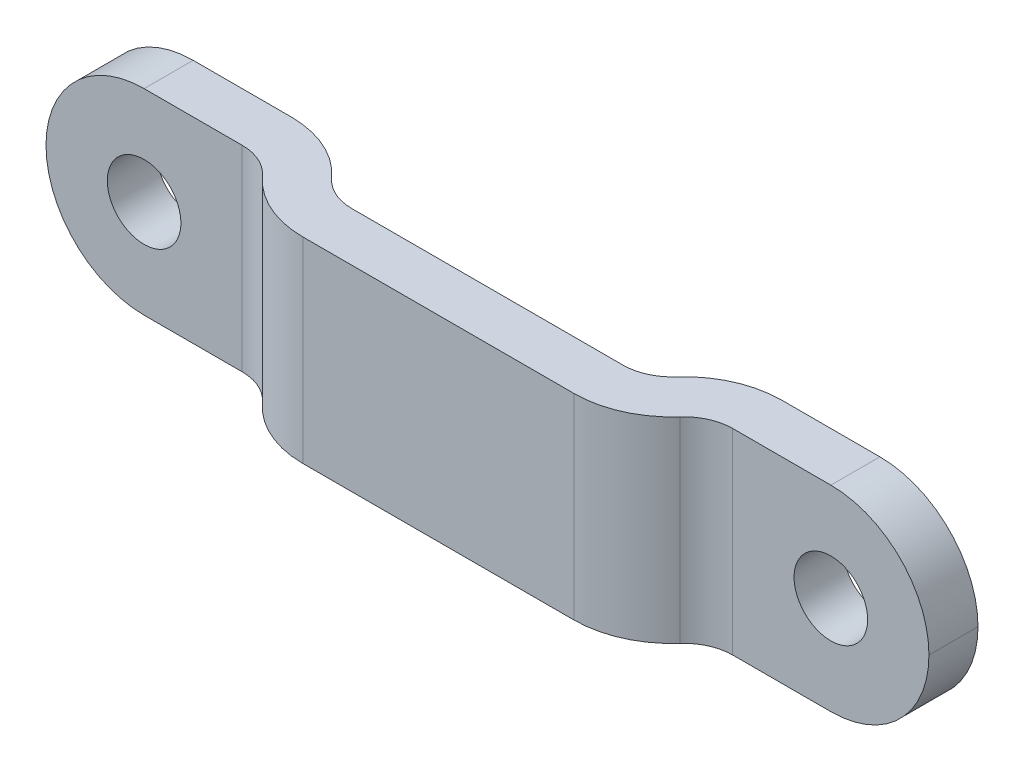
ISO-10303-21;
HEADER;
FILE_DESCRIPTION(('STEP AP214'),'2;1');
FILE_NAME('part.step','',(''),(''),'','','');
FILE_SCHEMA(('AUTOMOTIVE_DESIGN { 1 0 10303 214 1 1 1 1 }'));
ENDSEC;
DATA;
#1=APPLICATION_CONTEXT('core data for automotive mechanical design processes');
#2=APPLICATION_PROTOCOL_DEFINITION('international standard','automotive_design',2000,#1);
#3=PRODUCT_CONTEXT('',#1,'mechanical');
#4=PRODUCT('Part','Part','',(#3));
#5=PRODUCT_RELATED_PRODUCT_CATEGORY('part','',(#4));
#6=PRODUCT_DEFINITION_FORMATION('','',#4);
#7=PRODUCT_DEFINITION_CONTEXT('part definition',#1,'design');
#8=PRODUCT_DEFINITION('design','',#6,#7);
#9=PRODUCT_DEFINITION_SHAPE('','',#8);
#10=(LENGTH_UNIT() NAMED_UNIT(*) SI_UNIT(.MILLI.,.METRE.));
#11=(NAMED_UNIT(*) PLANE_ANGLE_UNIT() SI_UNIT($,.RADIAN.));
#12=(NAMED_UNIT(*) SI_UNIT($,.STERADIAN.) SOLID_ANGLE_UNIT());
#13=UNCERTAINTY_MEASURE_WITH_UNIT(LENGTH_MEASURE(1.E-05),#10,'distance_accuracy_value','');
#14=(GEOMETRIC_REPRESENTATION_CONTEXT(3) GLOBAL_UNCERTAINTY_ASSIGNED_CONTEXT((#13)) GLOBAL_UNIT_ASSIGNED_CONTEXT((#10,
#11,#12)) REPRESENTATION_CONTEXT('',''));
#15=CARTESIAN_POINT('',(0.,0.,0.));
#16=DIRECTION('',(0.,0.,1.));
#17=DIRECTION('',(1.,0.,0.));
#18=AXIS2_PLACEMENT_3D('',#15,#16,#17);
#19=CARTESIAN_POINT('',(-28.575,6.35,3.175));
#20=DIRECTION('',(0.,0.,-1.));
#21=DIRECTION('',(-1.,0.,0.));
#22=AXIS2_PLACEMENT_3D('',#19,#20,#21);
#23=PLANE('',#22);
#24=DIRECTION('',(1.,0.,0.));
#25=VECTOR('',#24,1.);
#26=CARTESIAN_POINT('',(-28.575,6.35,3.175));
#27=LINE('',#26,#25);
#28=CARTESIAN_POINT('',(-22.225,6.35,3.175));
#29=VERTEX_POINT('',#28);
#30=CARTESIAN_POINT('',(-15.875,6.35,3.175));
#31=VERTEX_POINT('',#30);
#32=EDGE_CURVE('E155',#29,#31,#27,.T.);
#33=ORIENTED_EDGE('',*,*,#32,.F.);
#34=CARTESIAN_POINT('',(-22.225,0.,3.175));
#35=DIRECTION('',(0.,0.,-1.));
#36=DIRECTION('',(-1.,0.,0.));
#37=AXIS2_PLACEMENT_3D('',#34,#35,#36);
#38=CIRCLE('',#37,6.35);
#39=CARTESIAN_POINT('',(-28.575,0.,3.175));
#40=VERTEX_POINT('',#39);
#41=EDGE_CURVE('E53',#29,#40,#38,.F.);
#42=ORIENTED_EDGE('',*,*,#41,.T.);
#43=CARTESIAN_POINT('',(-22.225,0.,3.175));
#44=DIRECTION('',(0.,0.,-1.));
#45=DIRECTION('',(-1.,0.,0.));
#46=AXIS2_PLACEMENT_3D('',#43,#44,#45);
#47=CIRCLE('',#46,6.35);
#48=CARTESIAN_POINT('',(-22.225,-6.35,3.175));
#49=VERTEX_POINT('',#48);
#50=EDGE_CURVE('E287',#40,#49,#47,.F.);
#51=ORIENTED_EDGE('',*,*,#50,.T.);
#52=DIRECTION('',(1.,0.,0.));
#53=VECTOR('',#52,1.);
#54=CARTESIAN_POINT('',(-28.575,-6.35,3.175));
#55=LINE('',#54,#53);
#56=CARTESIAN_POINT('',(-15.875,-6.35,3.175));
#57=VERTEX_POINT('',#56);
#58=EDGE_CURVE('E171',#49,#57,#55,.T.);
#59=ORIENTED_EDGE('',*,*,#58,.T.);
#60=DIRECTION('',(0.,-1.,0.));
#61=VECTOR('',#60,1.);
#62=CARTESIAN_POINT('',(-15.875,6.35,3.175));
#63=LINE('',#62,#61);
#64=EDGE_CURVE('E168',#31,#57,#63,.T.);
#65=ORIENTED_EDGE('',*,*,#64,.F.);
#66=EDGE_LOOP('',(#33,#42,#51,#59,#65));
#67=FACE_BOUND('',#66,.T.);
#68=CARTESIAN_POINT('',(-22.225,0.,3.175));
#69=DIRECTION('',(0.,0.,-1.));
#70=DIRECTION('',(-1.,0.,0.));
#71=AXIS2_PLACEMENT_3D('',#68,#69,#70);
#72=CIRCLE('',#71,2.38125);
#73=CARTESIAN_POINT('',(-24.60625,0.,3.175));
#74=VERTEX_POINT('',#73);
#75=EDGE_CURVE('E299',#74,#74,#72,.T.);
#76=ORIENTED_EDGE('',*,*,#75,.T.);
#77=EDGE_LOOP('',(#76));
#78=FACE_BOUND('',#77,.T.);
#79=ADVANCED_FACE('F30',(#67,#78),#23,.F.);
#80=CARTESIAN_POINT('',(-28.575,6.35,0.));
#81=DIRECTION('',(0.,0.,-1.));
#82=DIRECTION('',(-1.,0.,0.));
#83=AXIS2_PLACEMENT_3D('',#80,#81,#82);
#84=PLANE('',#83);
#85=CARTESIAN_POINT('',(-22.225,0.,0.));
#86=DIRECTION('',(0.,0.,-1.));
#87=DIRECTION('',(-1.,0.,0.));
#88=AXIS2_PLACEMENT_3D('',#85,#86,#87);
#89=CIRCLE('',#88,6.35);
#90=CARTESIAN_POINT('',(-22.225,-6.35,0.));
#91=VERTEX_POINT('',#90);
#92=CARTESIAN_POINT('',(-28.575,0.,0.));
#93=VERTEX_POINT('',#92);
#94=EDGE_CURVE('E39',#91,#93,#89,.T.);
#95=ORIENTED_EDGE('',*,*,#94,.T.);
#96=CARTESIAN_POINT('',(-22.225,0.,0.));
#97=DIRECTION('',(0.,0.,-1.));
#98=DIRECTION('',(-1.,0.,0.));
#99=AXIS2_PLACEMENT_3D('',#96,#97,#98);
#100=CIRCLE('',#99,6.35);
#101=CARTESIAN_POINT('',(-22.225,6.35,0.));
#102=VERTEX_POINT('',#101);
#103=EDGE_CURVE('E11',#93,#102,#100,.T.);
#104=ORIENTED_EDGE('',*,*,#103,.T.);
#105=DIRECTION('',(1.,0.,0.));
#106=VECTOR('',#105,1.);
#107=CARTESIAN_POINT('',(-28.575,6.35,0.));
#108=LINE('',#107,#106);
#109=CARTESIAN_POINT('',(-15.875,6.35,0.));
#110=VERTEX_POINT('',#109);
#111=EDGE_CURVE('E210',#102,#110,#108,.T.);
#112=ORIENTED_EDGE('',*,*,#111,.T.);
#113=DIRECTION('',(0.,-1.,0.));
#114=VECTOR('',#113,1.);
#115=CARTESIAN_POINT('',(-15.875,6.35,0.));
#116=LINE('',#115,#114);
#117=CARTESIAN_POINT('',(-15.875,-6.35,0.));
#118=VERTEX_POINT('',#117);
#119=EDGE_CURVE('E212',#110,#118,#116,.T.);
#120=ORIENTED_EDGE('',*,*,#119,.T.);
#121=DIRECTION('',(1.,0.,0.));
#122=VECTOR('',#121,1.);
#123=CARTESIAN_POINT('',(-28.575,-6.35,0.));
#124=LINE('',#123,#122);
#125=EDGE_CURVE('E165',#91,#118,#124,.T.);
#126=ORIENTED_EDGE('',*,*,#125,.F.);
#127=EDGE_LOOP('',(#95,#104,#112,#120,#126));
#128=FACE_BOUND('',#127,.T.);
#129=CARTESIAN_POINT('',(-22.225,0.,0.));
#130=DIRECTION('',(0.,0.,-1.));
#131=DIRECTION('',(-1.,0.,0.));
#132=AXIS2_PLACEMENT_3D('',#129,#130,#131);
#133=CIRCLE('',#132,2.38125);
#134=CARTESIAN_POINT('',(-24.60625,0.,0.));
#135=VERTEX_POINT('',#134);
#136=EDGE_CURVE('E295',#135,#135,#133,.T.);
#137=ORIENTED_EDGE('',*,*,#136,.F.);
#138=EDGE_LOOP('',(#137));
#139=FACE_BOUND('',#138,.T.);
#140=ADVANCED_FACE('F362',(#128,#139),#84,.T.);
#141=CARTESIAN_POINT('',(-15.875,6.35,6.35));
#142=DIRECTION('',(0.,-1.,0.));
#143=DIRECTION('',(0.,0.,-1.));
#144=AXIS2_PLACEMENT_3D('',#141,#142,#143);
#145=CYLINDRICAL_SURFACE('',#144,3.175);
#146=CARTESIAN_POINT('',(-15.875,-6.35,6.35));
#147=DIRECTION('',(0.,-1.,0.));
#148=DIRECTION('',(0.,0.,-1.));
#149=AXIS2_PLACEMENT_3D('',#146,#147,#148);
#150=CIRCLE('',#149,3.175);
#151=CARTESIAN_POINT('',(-13.5084947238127,-6.35,4.23333333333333));
#152=VERTEX_POINT('',#151);
#153=EDGE_CURVE('E214',#57,#152,#150,.T.);
#154=ORIENTED_EDGE('',*,*,#153,.T.);
#155=DIRECTION('',(0.,-1.,0.));
#156=VECTOR('',#155,1.);
#157=CARTESIAN_POINT('',(-13.5084947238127,6.35,4.23333333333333));
#158=LINE('',#157,#156);
#159=CARTESIAN_POINT('',(-13.5084947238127,6.35,4.23333333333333));
#160=VERTEX_POINT('',#159);
#161=EDGE_CURVE('E175',#160,#152,#158,.T.);
#162=ORIENTED_EDGE('',*,*,#161,.F.);
#163=CARTESIAN_POINT('',(-15.875,6.35,6.35));
#164=DIRECTION('',(0.,-1.,0.));
#165=DIRECTION('',(0.,0.,-1.));
#166=AXIS2_PLACEMENT_3D('',#163,#164,#165);
#167=CIRCLE('',#166,3.175);
#168=EDGE_CURVE('E160',#31,#160,#167,.T.);
#169=ORIENTED_EDGE('',*,*,#168,.F.);
#170=ORIENTED_EDGE('',*,*,#64,.T.);
#171=EDGE_LOOP('',(#154,#162,#169,#170));
#172=FACE_BOUND('',#171,.T.);
#173=ADVANCED_FACE('F177',(#172),#145,.F.);
#174=CARTESIAN_POINT('',(-8.77548417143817,6.35,0.));
#175=DIRECTION('',(0.,-1.,0.));
#176=DIRECTION('',(0.,0.,-1.));
#177=AXIS2_PLACEMENT_3D('',#174,#175,#176);
#178=CYLINDRICAL_SURFACE('',#177,6.35);
#179=CARTESIAN_POINT('',(-8.77548417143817,-6.35,0.));
#180=DIRECTION('',(0.,1.,0.));
#181=DIRECTION('',(0.,0.,1.));
#182=AXIS2_PLACEMENT_3D('',#179,#180,#181);
#183=CIRCLE('',#182,6.35);
#184=CARTESIAN_POINT('',(-8.77548417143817,-6.35,6.35));
#185=VERTEX_POINT('',#184);
#186=EDGE_CURVE('E217',#152,#185,#183,.T.);
#187=ORIENTED_EDGE('',*,*,#186,.T.);
#188=DIRECTION('',(0.,-1.,0.));
#189=VECTOR('',#188,1.);
#190=CARTESIAN_POINT('',(-8.77548417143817,6.35,6.35));
#191=LINE('',#190,#189);
#192=CARTESIAN_POINT('',(-8.77548417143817,6.35,6.35));
#193=VERTEX_POINT('',#192);
#194=EDGE_CURVE('E268',#193,#185,#191,.T.);
#195=ORIENTED_EDGE('',*,*,#194,.F.);
#196=CARTESIAN_POINT('',(-8.77548417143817,6.35,0.));
#197=DIRECTION('',(0.,1.,0.));
#198=DIRECTION('',(0.,0.,1.));
#199=AXIS2_PLACEMENT_3D('',#196,#197,#198);
#200=CIRCLE('',#199,6.35);
#201=EDGE_CURVE('E180',#160,#193,#200,.T.);
#202=ORIENTED_EDGE('',*,*,#201,.F.);
#203=ORIENTED_EDGE('',*,*,#161,.T.);
#204=EDGE_LOOP('',(#187,#195,#202,#203));
#205=FACE_BOUND('',#204,.T.);
#206=ADVANCED_FACE('F416',(#205),#178,.T.);
#207=CARTESIAN_POINT('',(-8.77548417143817,6.35,6.35));
#208=DIRECTION('',(0.,0.,-1.));
#209=DIRECTION('',(-1.,0.,0.));
#210=AXIS2_PLACEMENT_3D('',#207,#208,#209);
#211=PLANE('',#210);
#212=DIRECTION('',(1.,0.,0.));
#213=VECTOR('',#212,1.);
#214=CARTESIAN_POINT('',(-8.77548417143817,-6.35,6.35));
#215=LINE('',#214,#213);
#216=CARTESIAN_POINT('',(8.77548417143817,-6.35,6.35));
#217=VERTEX_POINT('',#216);
#218=EDGE_CURVE('E219',#185,#217,#215,.T.);
#219=ORIENTED_EDGE('',*,*,#218,.T.);
#220=DIRECTION('',(0.,-1.,0.));
#221=VECTOR('',#220,1.);
#222=CARTESIAN_POINT('',(8.77548417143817,6.35,6.35));
#223=LINE('',#222,#221);
#224=CARTESIAN_POINT('',(8.77548417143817,6.35,6.35));
#225=VERTEX_POINT('',#224);
#226=EDGE_CURVE('E266',#225,#217,#223,.T.);
#227=ORIENTED_EDGE('',*,*,#226,.F.);
#228=DIRECTION('',(1.,0.,0.));
#229=VECTOR('',#228,1.);
#230=CARTESIAN_POINT('',(-8.77548417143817,6.35,6.35));
#231=LINE('',#230,#229);
#232=EDGE_CURVE('E182',#193,#225,#231,.T.);
#233=ORIENTED_EDGE('',*,*,#232,.F.);
#234=ORIENTED_EDGE('',*,*,#194,.T.);
#235=EDGE_LOOP('',(#219,#227,#233,#234));
#236=FACE_BOUND('',#235,.T.);
#237=ADVANCED_FACE('F413',(#236),#211,.F.);
#238=CARTESIAN_POINT('',(8.77548417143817,6.35,0.));
#239=DIRECTION('',(0.,-1.,0.));
#240=DIRECTION('',(0.,0.,-1.));
#241=AXIS2_PLACEMENT_3D('',#238,#239,#240);
#242=CYLINDRICAL_SURFACE('',#241,6.35);
#243=CARTESIAN_POINT('',(8.77548417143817,-6.35,0.));
#244=DIRECTION('',(0.,-1.,0.));
#245=DIRECTION('',(0.,0.,-1.));
#246=AXIS2_PLACEMENT_3D('',#243,#244,#245);
#247=CIRCLE('',#246,6.35);
#248=CARTESIAN_POINT('',(13.5084947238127,-6.35,4.23333333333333));
#249=VERTEX_POINT('',#248);
#250=EDGE_CURVE('E222',#249,#217,#247,.T.);
#251=ORIENTED_EDGE('',*,*,#250,.F.);
#252=DIRECTION('',(0.,-1.,0.));
#253=VECTOR('',#252,1.);
#254=CARTESIAN_POINT('',(13.5084947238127,6.35,4.23333333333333));
#255=LINE('',#254,#253);
#256=CARTESIAN_POINT('',(13.5084947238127,6.35,4.23333333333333));
#257=VERTEX_POINT('',#256);
#258=EDGE_CURVE('E264',#257,#249,#255,.T.);
#259=ORIENTED_EDGE('',*,*,#258,.F.);
#260=CARTESIAN_POINT('',(8.77548417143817,6.35,0.));
#261=DIRECTION('',(0.,-1.,0.));
#262=DIRECTION('',(0.,0.,-1.));
#263=AXIS2_PLACEMENT_3D('',#260,#261,#262);
#264=CIRCLE('',#263,6.35);
#265=EDGE_CURVE('E187',#257,#225,#264,.T.);
#266=ORIENTED_EDGE('',*,*,#265,.T.);
#267=ORIENTED_EDGE('',*,*,#226,.T.);
#268=EDGE_LOOP('',(#251,#259,#266,#267));
#269=FACE_BOUND('',#268,.T.);
#270=ADVANCED_FACE('F409',(#269),#242,.T.);
#271=CARTESIAN_POINT('',(15.875,6.35,6.35));
#272=DIRECTION('',(0.,-1.,0.));
#273=DIRECTION('',(0.,0.,-1.));
#274=AXIS2_PLACEMENT_3D('',#271,#272,#273);
#275=CYLINDRICAL_SURFACE('',#274,3.175);
#276=CARTESIAN_POINT('',(15.875,-6.35,6.35));
#277=DIRECTION('',(0.,1.,0.));
#278=DIRECTION('',(0.,0.,1.));
#279=AXIS2_PLACEMENT_3D('',#276,#277,#278);
#280=CIRCLE('',#279,3.175);
#281=CARTESIAN_POINT('',(15.875,-6.35,3.175));
#282=VERTEX_POINT('',#281);
#283=EDGE_CURVE('E225',#282,#249,#280,.T.);
#284=ORIENTED_EDGE('',*,*,#283,.F.);
#285=DIRECTION('',(0.,-1.,0.));
#286=VECTOR('',#285,1.);
#287=CARTESIAN_POINT('',(15.875,6.35,3.175));
#288=LINE('',#287,#286);
#289=CARTESIAN_POINT('',(15.875,6.35,3.175));
#290=VERTEX_POINT('',#289);
#291=EDGE_CURVE('E261',#290,#282,#288,.T.);
#292=ORIENTED_EDGE('',*,*,#291,.F.);
#293=CARTESIAN_POINT('',(15.875,6.35,6.35));
#294=DIRECTION('',(0.,1.,0.));
#295=DIRECTION('',(0.,0.,1.));
#296=AXIS2_PLACEMENT_3D('',#293,#294,#295);
#297=CIRCLE('',#296,3.175);
#298=EDGE_CURVE('E190',#290,#257,#297,.T.);
#299=ORIENTED_EDGE('',*,*,#298,.T.);
#300=ORIENTED_EDGE('',*,*,#258,.T.);
#301=EDGE_LOOP('',(#284,#292,#299,#300));
#302=FACE_BOUND('',#301,.T.);
#303=ADVANCED_FACE('F325',(#302),#275,.F.);
#304=CARTESIAN_POINT('',(28.575,6.35,3.175));
#305=DIRECTION('',(0.,0.,1.));
#306=DIRECTION('',(1.,0.,0.));
#307=AXIS2_PLACEMENT_3D('',#304,#305,#306);
#308=PLANE('',#307);
#309=CARTESIAN_POINT('',(22.225,0.,3.175));
#310=DIRECTION('',(0.,0.,1.));
#311=DIRECTION('',(1.,0.,0.));
#312=AXIS2_PLACEMENT_3D('',#309,#310,#311);
#313=CIRCLE('',#312,2.38125);
#314=CARTESIAN_POINT('',(24.60625,0.,3.175));
#315=VERTEX_POINT('',#314);
#316=EDGE_CURVE('E306',#315,#315,#313,.T.);
#317=ORIENTED_EDGE('',*,*,#316,.F.);
#318=EDGE_LOOP('',(#317));
#319=FACE_BOUND('',#318,.T.);
#320=CARTESIAN_POINT('',(22.225,0.,3.175));
#321=DIRECTION('',(0.,0.,1.));
#322=DIRECTION('',(1.,0.,0.));
#323=AXIS2_PLACEMENT_3D('',#320,#321,#322);
#324=CIRCLE('',#323,6.35);
#325=CARTESIAN_POINT('',(22.225,-6.35,3.175));
#326=VERTEX_POINT('',#325);
#327=CARTESIAN_POINT('',(28.575,0.,3.175));
#328=VERTEX_POINT('',#327);
#329=EDGE_CURVE('E174',#326,#328,#324,.T.);
#330=ORIENTED_EDGE('',*,*,#329,.T.);
#331=CARTESIAN_POINT('',(22.225,0.,3.175));
#332=DIRECTION('',(0.,0.,1.));
#333=DIRECTION('',(1.,0.,0.));
#334=AXIS2_PLACEMENT_3D('',#331,#332,#333);
#335=CIRCLE('',#334,6.35);
#336=CARTESIAN_POINT('',(22.225,6.35,3.175));
#337=VERTEX_POINT('',#336);
#338=EDGE_CURVE('E273',#328,#337,#335,.T.);
#339=ORIENTED_EDGE('',*,*,#338,.T.);
#340=DIRECTION('',(-1.,0.,0.));
#341=VECTOR('',#340,1.);
#342=CARTESIAN_POINT('',(28.575,6.35,3.175));
#343=LINE('',#342,#341);
#344=EDGE_CURVE('E193',#337,#290,#343,.T.);
#345=ORIENTED_EDGE('',*,*,#344,.T.);
#346=ORIENTED_EDGE('',*,*,#291,.T.);
#347=DIRECTION('',(-1.,0.,0.));
#348=VECTOR('',#347,1.);
#349=CARTESIAN_POINT('',(28.575,-6.35,3.175));
#350=LINE('',#349,#348);
#351=EDGE_CURVE('E228',#326,#282,#350,.T.);
#352=ORIENTED_EDGE('',*,*,#351,.F.);
#353=EDGE_LOOP('',(#330,#339,#345,#346,#352));
#354=FACE_BOUND('',#353,.T.);
#355=ADVANCED_FACE('F322',(#319,#354),#308,.T.);
#356=CARTESIAN_POINT('',(28.575,6.35,0.));
#357=DIRECTION('',(0.,0.,1.));
#358=DIRECTION('',(1.,0.,0.));
#359=AXIS2_PLACEMENT_3D('',#356,#357,#358);
#360=PLANE('',#359);
#361=CARTESIAN_POINT('',(22.225,0.,0.));
#362=DIRECTION('',(0.,0.,1.));
#363=DIRECTION('',(1.,0.,0.));
#364=AXIS2_PLACEMENT_3D('',#361,#362,#363);
#365=CIRCLE('',#364,2.38125);
#366=CARTESIAN_POINT('',(24.60625,0.,0.));
#367=VERTEX_POINT('',#366);
#368=EDGE_CURVE('E304',#367,#367,#365,.T.);
#369=ORIENTED_EDGE('',*,*,#368,.T.);
#370=EDGE_LOOP('',(#369));
#371=FACE_BOUND('',#370,.T.);
#372=DIRECTION('',(-1.,0.,0.));
#373=VECTOR('',#372,1.);
#374=CARTESIAN_POINT('',(28.575,6.35,0.));
#375=LINE('',#374,#373);
#376=CARTESIAN_POINT('',(22.225,6.35,0.));
#377=VERTEX_POINT('',#376);
#378=CARTESIAN_POINT('',(15.875,6.35,0.));
#379=VERTEX_POINT('',#378);
#380=EDGE_CURVE('E195',#377,#379,#375,.T.);
#381=ORIENTED_EDGE('',*,*,#380,.F.);
#382=CARTESIAN_POINT('',(22.225,0.,0.));
#383=DIRECTION('',(0.,0.,1.));
#384=DIRECTION('',(1.,0.,0.));
#385=AXIS2_PLACEMENT_3D('',#382,#383,#384);
#386=CIRCLE('',#385,6.35);
#387=CARTESIAN_POINT('',(28.575,0.,0.));
#388=VERTEX_POINT('',#387);
#389=EDGE_CURVE('E281',#377,#388,#386,.F.);
#390=ORIENTED_EDGE('',*,*,#389,.T.);
#391=CARTESIAN_POINT('',(22.225,0.,0.));
#392=DIRECTION('',(0.,0.,1.));
#393=DIRECTION('',(1.,0.,0.));
#394=AXIS2_PLACEMENT_3D('',#391,#392,#393);
#395=CIRCLE('',#394,6.35);
#396=CARTESIAN_POINT('',(22.225,-6.35,0.));
#397=VERTEX_POINT('',#396);
#398=EDGE_CURVE('E279',#388,#397,#395,.F.);
#399=ORIENTED_EDGE('',*,*,#398,.T.);
#400=DIRECTION('',(-1.,0.,0.));
#401=VECTOR('',#400,1.);
#402=CARTESIAN_POINT('',(28.575,-6.35,0.));
#403=LINE('',#402,#401);
#404=CARTESIAN_POINT('',(15.875,-6.35,0.));
#405=VERTEX_POINT('',#404);
#406=EDGE_CURVE('E230',#397,#405,#403,.T.);
#407=ORIENTED_EDGE('',*,*,#406,.T.);
#408=DIRECTION('',(0.,-1.,0.));
#409=VECTOR('',#408,1.);
#410=CARTESIAN_POINT('',(15.875,6.35,0.));
#411=LINE('',#410,#409);
#412=EDGE_CURVE('E258',#379,#405,#411,.T.);
#413=ORIENTED_EDGE('',*,*,#412,.F.);
#414=EDGE_LOOP('',(#381,#390,#399,#407,#413));
#415=FACE_BOUND('',#414,.T.);
#416=ADVANCED_FACE('F312',(#371,#415),#360,.F.);
#417=CARTESIAN_POINT('',(15.875,6.35,6.35));
#418=DIRECTION('',(0.,-1.,0.));
#419=DIRECTION('',(0.,0.,-1.));
#420=AXIS2_PLACEMENT_3D('',#417,#418,#419);
#421=CYLINDRICAL_SURFACE('',#420,6.35);
#422=CARTESIAN_POINT('',(15.875,-6.35,6.35));
#423=DIRECTION('',(0.,1.,0.));
#424=DIRECTION('',(0.,0.,1.));
#425=AXIS2_PLACEMENT_3D('',#422,#423,#424);
#426=CIRCLE('',#425,6.35);
#427=CARTESIAN_POINT('',(11.1419894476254,-6.35,2.11666666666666));
#428=VERTEX_POINT('',#427);
#429=EDGE_CURVE('E232',#405,#428,#426,.T.);
#430=ORIENTED_EDGE('',*,*,#429,.T.);
#431=DIRECTION('',(0.,-1.,0.));
#432=VECTOR('',#431,1.);
#433=CARTESIAN_POINT('',(11.1419894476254,6.35,2.11666666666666));
#434=LINE('',#433,#432);
#435=CARTESIAN_POINT('',(11.1419894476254,6.35,2.11666666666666));
#436=VERTEX_POINT('',#435);
#437=EDGE_CURVE('E255',#436,#428,#434,.T.);
#438=ORIENTED_EDGE('',*,*,#437,.F.);
#439=CARTESIAN_POINT('',(15.875,6.35,6.35));
#440=DIRECTION('',(0.,1.,0.));
#441=DIRECTION('',(0.,0.,1.));
#442=AXIS2_PLACEMENT_3D('',#439,#440,#441);
#443=CIRCLE('',#442,6.35);
#444=EDGE_CURVE('E197',#379,#436,#443,.T.);
#445=ORIENTED_EDGE('',*,*,#444,.F.);
#446=ORIENTED_EDGE('',*,*,#412,.T.);
#447=EDGE_LOOP('',(#430,#438,#445,#446));
#448=FACE_BOUND('',#447,.T.);
#449=ADVANCED_FACE('F343',(#448),#421,.T.);
#450=CARTESIAN_POINT('',(8.77548417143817,6.35,0.));
#451=DIRECTION('',(0.,-1.,0.));
#452=DIRECTION('',(0.,0.,-1.));
#453=AXIS2_PLACEMENT_3D('',#450,#451,#452);
#454=CYLINDRICAL_SURFACE('',#453,3.175);
#455=CARTESIAN_POINT('',(8.77548417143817,-6.35,0.));
#456=DIRECTION('',(0.,-1.,0.));
#457=DIRECTION('',(0.,0.,-1.));
#458=AXIS2_PLACEMENT_3D('',#455,#456,#457);
#459=CIRCLE('',#458,3.175);
#460=CARTESIAN_POINT('',(8.77548417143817,-6.35,3.175));
#461=VERTEX_POINT('',#460);
#462=EDGE_CURVE('E234',#428,#461,#459,.T.);
#463=ORIENTED_EDGE('',*,*,#462,.T.);
#464=DIRECTION('',(0.,-1.,0.));
#465=VECTOR('',#464,1.);
#466=CARTESIAN_POINT('',(8.77548417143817,6.35,3.175));
#467=LINE('',#466,#465);
#468=CARTESIAN_POINT('',(8.77548417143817,6.35,3.175));
#469=VERTEX_POINT('',#468);
#470=EDGE_CURVE('E253',#469,#461,#467,.T.);
#471=ORIENTED_EDGE('',*,*,#470,.F.);
#472=CARTESIAN_POINT('',(8.77548417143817,6.35,0.));
#473=DIRECTION('',(0.,-1.,0.));
#474=DIRECTION('',(0.,0.,-1.));
#475=AXIS2_PLACEMENT_3D('',#472,#473,#474);
#476=CIRCLE('',#475,3.175);
#477=EDGE_CURVE('E199',#436,#469,#476,.T.);
#478=ORIENTED_EDGE('',*,*,#477,.F.);
#479=ORIENTED_EDGE('',*,*,#437,.T.);
#480=EDGE_LOOP('',(#463,#471,#478,#479));
#481=FACE_BOUND('',#480,.T.);
#482=ADVANCED_FACE('F349',(#481),#454,.F.);
#483=CARTESIAN_POINT('',(-8.77548417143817,6.35,3.175));
#484=DIRECTION('',(0.,0.,-1.));
#485=DIRECTION('',(-1.,0.,0.));
#486=AXIS2_PLACEMENT_3D('',#483,#484,#485);
#487=PLANE('',#486);
#488=DIRECTION('',(1.,0.,0.));
#489=VECTOR('',#488,1.);
#490=CARTESIAN_POINT('',(-8.77548417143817,-6.35,3.175));
#491=LINE('',#490,#489);
#492=CARTESIAN_POINT('',(-8.77548417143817,-6.35,3.175));
#493=VERTEX_POINT('',#492);
#494=EDGE_CURVE('E237',#493,#461,#491,.T.);
#495=ORIENTED_EDGE('',*,*,#494,.F.);
#496=DIRECTION('',(0.,-1.,0.));
#497=VECTOR('',#496,1.);
#498=CARTESIAN_POINT('',(-8.77548417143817,6.35,3.175));
#499=LINE('',#498,#497);
#500=CARTESIAN_POINT('',(-8.77548417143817,6.35,3.175));
#501=VERTEX_POINT('',#500);
#502=EDGE_CURVE('E251',#501,#493,#499,.T.);
#503=ORIENTED_EDGE('',*,*,#502,.F.);
#504=DIRECTION('',(1.,0.,0.));
#505=VECTOR('',#504,1.);
#506=CARTESIAN_POINT('',(-8.77548417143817,6.35,3.175));
#507=LINE('',#506,#505);
#508=EDGE_CURVE('E201',#501,#469,#507,.T.);
#509=ORIENTED_EDGE('',*,*,#508,.T.);
#510=ORIENTED_EDGE('',*,*,#470,.T.);
#511=EDGE_LOOP('',(#495,#503,#509,#510));
#512=FACE_BOUND('',#511,.T.);
#513=ADVANCED_FACE('F353',(#512),#487,.T.);
#514=CARTESIAN_POINT('',(-8.77548417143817,6.35,0.));
#515=DIRECTION('',(0.,-1.,0.));
#516=DIRECTION('',(0.,0.,-1.));
#517=AXIS2_PLACEMENT_3D('',#514,#515,#516);
#518=CYLINDRICAL_SURFACE('',#517,3.175);
#519=CARTESIAN_POINT('',(-8.77548417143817,-6.35,0.));
#520=DIRECTION('',(0.,1.,0.));
#521=DIRECTION('',(0.,0.,1.));
#522=AXIS2_PLACEMENT_3D('',#519,#520,#521);
#523=CIRCLE('',#522,3.175);
#524=CARTESIAN_POINT('',(-11.1419894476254,-6.35,2.11666666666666));
#525=VERTEX_POINT('',#524);
#526=EDGE_CURVE('E240',#525,#493,#523,.T.);
#527=ORIENTED_EDGE('',*,*,#526,.F.);
#528=DIRECTION('',(0.,-1.,0.));
#529=VECTOR('',#528,1.);
#530=CARTESIAN_POINT('',(-11.1419894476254,6.35,2.11666666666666));
#531=LINE('',#530,#529);
#532=CARTESIAN_POINT('',(-11.1419894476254,6.35,2.11666666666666));
#533=VERTEX_POINT('',#532);
#534=EDGE_CURVE('E249',#533,#525,#531,.T.);
#535=ORIENTED_EDGE('',*,*,#534,.F.);
#536=CARTESIAN_POINT('',(-8.77548417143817,6.35,0.));
#537=DIRECTION('',(0.,1.,0.));
#538=DIRECTION('',(0.,0.,1.));
#539=AXIS2_PLACEMENT_3D('',#536,#537,#538);
#540=CIRCLE('',#539,3.175);
#541=EDGE_CURVE('E204',#533,#501,#540,.T.);
#542=ORIENTED_EDGE('',*,*,#541,.T.);
#543=ORIENTED_EDGE('',*,*,#502,.T.);
#544=EDGE_LOOP('',(#527,#535,#542,#543));
#545=FACE_BOUND('',#544,.T.);
#546=ADVANCED_FACE('F356',(#545),#518,.F.);
#547=CARTESIAN_POINT('',(-15.875,6.35,6.35));
#548=DIRECTION('',(0.,-1.,0.));
#549=DIRECTION('',(0.,0.,-1.));
#550=AXIS2_PLACEMENT_3D('',#547,#548,#549);
#551=CYLINDRICAL_SURFACE('',#550,6.35);
#552=CARTESIAN_POINT('',(-15.875,-6.35,6.35));
#553=DIRECTION('',(0.,-1.,0.));
#554=DIRECTION('',(0.,0.,-1.));
#555=AXIS2_PLACEMENT_3D('',#552,#553,#554);
#556=CIRCLE('',#555,6.35);
#557=EDGE_CURVE('E243',#118,#525,#556,.T.);
#558=ORIENTED_EDGE('',*,*,#557,.F.);
#559=ORIENTED_EDGE('',*,*,#119,.F.);
#560=CARTESIAN_POINT('',(-15.875,6.35,6.35));
#561=DIRECTION('',(0.,-1.,0.));
#562=DIRECTION('',(0.,0.,-1.));
#563=AXIS2_PLACEMENT_3D('',#560,#561,#562);
#564=CIRCLE('',#563,6.35);
#565=EDGE_CURVE('E207',#110,#533,#564,.T.);
#566=ORIENTED_EDGE('',*,*,#565,.T.);
#567=ORIENTED_EDGE('',*,*,#534,.T.);
#568=EDGE_LOOP('',(#558,#559,#566,#567));
#569=FACE_BOUND('',#568,.T.);
#570=ADVANCED_FACE('F361',(#569),#551,.T.);
#571=CARTESIAN_POINT('',(-15.875,6.35,6.35));
#572=DIRECTION('',(0.,-1.,0.));
#573=DIRECTION('',(0.,0.,-1.));
#574=AXIS2_PLACEMENT_3D('',#571,#572,#573);
#575=PLANE('',#574);
#576=ORIENTED_EDGE('',*,*,#344,.F.);
#577=DIRECTION('',(0.,0.,1.));
#578=VECTOR('',#577,1.);
#579=CARTESIAN_POINT('',(22.225,6.35,0.));
#580=LINE('',#579,#578);
#581=EDGE_CURVE('E276',#337,#377,#580,.F.);
#582=ORIENTED_EDGE('',*,*,#581,.T.);
#583=ORIENTED_EDGE('',*,*,#380,.T.);
#584=ORIENTED_EDGE('',*,*,#444,.T.);
#585=ORIENTED_EDGE('',*,*,#477,.T.);
#586=ORIENTED_EDGE('',*,*,#508,.F.);
#587=ORIENTED_EDGE('',*,*,#541,.F.);
#588=ORIENTED_EDGE('',*,*,#565,.F.);
#589=ORIENTED_EDGE('',*,*,#111,.F.);
#590=DIRECTION('',(0.,0.,1.));
#591=VECTOR('',#590,1.);
#592=CARTESIAN_POINT('',(-22.225,6.35,6.35));
#593=LINE('',#592,#591);
#594=EDGE_CURVE('E164',#102,#29,#593,.T.);
#595=ORIENTED_EDGE('',*,*,#594,.T.);
#596=ORIENTED_EDGE('',*,*,#32,.T.);
#597=ORIENTED_EDGE('',*,*,#168,.T.);
#598=ORIENTED_EDGE('',*,*,#201,.T.);
#599=ORIENTED_EDGE('',*,*,#232,.T.);
#600=ORIENTED_EDGE('',*,*,#265,.F.);
#601=ORIENTED_EDGE('',*,*,#298,.F.);
#602=EDGE_LOOP('',(#576,#582,#583,#584,#585,#586,#587,#588,#589,#595,#596,#597,#598,#599,#600,#601));
#603=FACE_BOUND('',#602,.T.);
#604=ADVANCED_FACE('F158',(#603),#575,.F.);
#605=CARTESIAN_POINT('',(-15.875,-6.35,6.35));
#606=DIRECTION('',(0.,-1.,0.));
#607=DIRECTION('',(0.,0.,-1.));
#608=AXIS2_PLACEMENT_3D('',#605,#606,#607);
#609=PLANE('',#608);
#610=ORIENTED_EDGE('',*,*,#406,.F.);
#611=DIRECTION('',(0.,0.,1.));
#612=VECTOR('',#611,1.);
#613=CARTESIAN_POINT('',(22.225,-6.35,6.35));
#614=LINE('',#613,#612);
#615=EDGE_CURVE('E285',#397,#326,#614,.T.);
#616=ORIENTED_EDGE('',*,*,#615,.T.);
#617=ORIENTED_EDGE('',*,*,#351,.T.);
#618=ORIENTED_EDGE('',*,*,#283,.T.);
#619=ORIENTED_EDGE('',*,*,#250,.T.);
#620=ORIENTED_EDGE('',*,*,#218,.F.);
#621=ORIENTED_EDGE('',*,*,#186,.F.);
#622=ORIENTED_EDGE('',*,*,#153,.F.);
#623=ORIENTED_EDGE('',*,*,#58,.F.);
#624=DIRECTION('',(0.,0.,1.));
#625=VECTOR('',#624,1.);
#626=CARTESIAN_POINT('',(-22.225,-6.35,0.));
#627=LINE('',#626,#625);
#628=EDGE_CURVE('E283',#49,#91,#627,.F.);
#629=ORIENTED_EDGE('',*,*,#628,.T.);
#630=ORIENTED_EDGE('',*,*,#125,.T.);
#631=ORIENTED_EDGE('',*,*,#557,.T.);
#632=ORIENTED_EDGE('',*,*,#526,.T.);
#633=ORIENTED_EDGE('',*,*,#494,.T.);
#634=ORIENTED_EDGE('',*,*,#462,.F.);
#635=ORIENTED_EDGE('',*,*,#429,.F.);
#636=EDGE_LOOP('',(#610,#616,#617,#618,#619,#620,#621,#622,#623,#629,#630,#631,#632,#633,#634,#635));
#637=FACE_BOUND('',#636,.T.);
#638=ADVANCED_FACE('F384',(#637),#609,.T.);
#639=CARTESIAN_POINT('',(22.225,0.,6.35));
#640=DIRECTION('',(0.,0.,1.));
#641=DIRECTION('',(1.,0.,0.));
#642=AXIS2_PLACEMENT_3D('',#639,#640,#641);
#643=CYLINDRICAL_SURFACE('',#642,6.35);
#644=ORIENTED_EDGE('',*,*,#615,.F.);
#645=ORIENTED_EDGE('',*,*,#398,.F.);
#646=DIRECTION('',(0.,0.,1.));
#647=VECTOR('',#646,1.);
#648=CARTESIAN_POINT('',(28.575,0.,0.));
#649=LINE('',#648,#647);
#650=EDGE_CURVE('E215',#328,#388,#649,.F.);
#651=ORIENTED_EDGE('',*,*,#650,.F.);
#652=ORIENTED_EDGE('',*,*,#329,.F.);
#653=EDGE_LOOP('',(#644,#645,#651,#652));
#654=FACE_BOUND('',#653,.T.);
#655=ADVANCED_FACE('F332',(#654),#643,.T.);
#656=CARTESIAN_POINT('',(22.225,0.,0.));
#657=DIRECTION('',(0.,0.,-1.));
#658=DIRECTION('',(-1.,0.,0.));
#659=AXIS2_PLACEMENT_3D('',#656,#657,#658);
#660=CYLINDRICAL_SURFACE('',#659,6.35);
#661=ORIENTED_EDGE('',*,*,#389,.F.);
#662=ORIENTED_EDGE('',*,*,#581,.F.);
#663=ORIENTED_EDGE('',*,*,#338,.F.);
#664=ORIENTED_EDGE('',*,*,#650,.T.);
#665=EDGE_LOOP('',(#661,#662,#663,#664));
#666=FACE_BOUND('',#665,.T.);
#667=ADVANCED_FACE('F334',(#666),#660,.T.);
#668=CARTESIAN_POINT('',(-22.225,0.,0.));
#669=DIRECTION('',(0.,0.,-1.));
#670=DIRECTION('',(-1.,0.,0.));
#671=AXIS2_PLACEMENT_3D('',#668,#669,#670);
#672=CYLINDRICAL_SURFACE('',#671,6.35);
#673=DIRECTION('',(0.,0.,1.));
#674=VECTOR('',#673,1.);
#675=CARTESIAN_POINT('',(-28.575,0.,3.175));
#676=LINE('',#675,#674);
#677=EDGE_CURVE('E34',#93,#40,#676,.T.);
#678=ORIENTED_EDGE('',*,*,#677,.F.);
#679=ORIENTED_EDGE('',*,*,#94,.F.);
#680=ORIENTED_EDGE('',*,*,#628,.F.);
#681=ORIENTED_EDGE('',*,*,#50,.F.);
#682=EDGE_LOOP('',(#678,#679,#680,#681));
#683=FACE_BOUND('',#682,.T.);
#684=ADVANCED_FACE('F32',(#683),#672,.T.);
#685=CARTESIAN_POINT('',(-22.225,0.,6.35));
#686=DIRECTION('',(0.,0.,1.));
#687=DIRECTION('',(1.,0.,0.));
#688=AXIS2_PLACEMENT_3D('',#685,#686,#687);
#689=CYLINDRICAL_SURFACE('',#688,6.35);
#690=ORIENTED_EDGE('',*,*,#103,.F.);
#691=ORIENTED_EDGE('',*,*,#677,.T.);
#692=ORIENTED_EDGE('',*,*,#41,.F.);
#693=ORIENTED_EDGE('',*,*,#594,.F.);
#694=EDGE_LOOP('',(#690,#691,#692,#693));
#695=FACE_BOUND('',#694,.T.);
#696=ADVANCED_FACE('F364',(#695),#689,.T.);
#697=CARTESIAN_POINT('',(-22.225,0.,0.));
#698=DIRECTION('',(0.,0.,1.));
#699=DIRECTION('',(1.,0.,0.));
#700=AXIS2_PLACEMENT_3D('',#697,#698,#699);
#701=CYLINDRICAL_SURFACE('',#700,2.38125);
#702=ORIENTED_EDGE('',*,*,#136,.T.);
#703=EDGE_LOOP('',(#702));
#704=FACE_BOUND('',#703,.T.);
#705=ORIENTED_EDGE('',*,*,#75,.F.);
#706=EDGE_LOOP('',(#705));
#707=FACE_BOUND('',#706,.T.);
#708=ADVANCED_FACE('F318',(#704,#707),#701,.F.);
#709=CARTESIAN_POINT('',(22.225,0.,0.));
#710=DIRECTION('',(0.,0.,1.));
#711=DIRECTION('',(1.,0.,0.));
#712=AXIS2_PLACEMENT_3D('',#709,#710,#711);
#713=CYLINDRICAL_SURFACE('',#712,2.38125);
#714=ORIENTED_EDGE('',*,*,#368,.F.);
#715=EDGE_LOOP('',(#714));
#716=FACE_BOUND('',#715,.T.);
#717=ORIENTED_EDGE('',*,*,#316,.T.);
#718=EDGE_LOOP('',(#717));
#719=FACE_BOUND('',#718,.T.);
#720=ADVANCED_FACE('F315',(#716,#719),#713,.F.);
#721=CLOSED_SHELL('',(#79,#140,#173,#206,#237,#270,#303,#355,#416,#449,#482,#513,#546,#570,#604,
#638,#655,#667,#684,#696,#708,#720));
#722=MANIFOLD_SOLID_BREP('B2',#721);
#723=ADVANCED_BREP_SHAPE_REPRESENTATION('',(#18,#722),#14);
#724=SHAPE_DEFINITION_REPRESENTATION(#9,#723);
ENDSEC;
END-ISO-10303-21;
